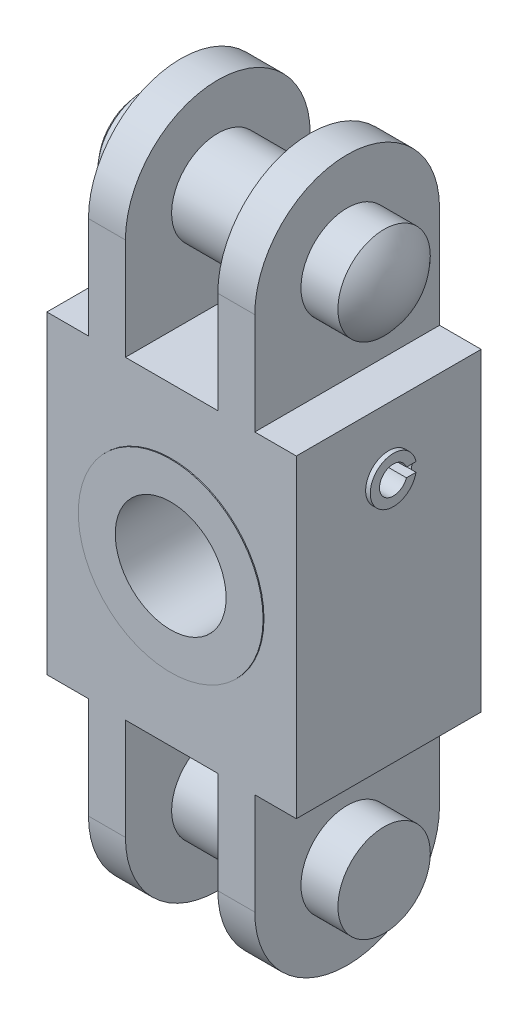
ISO-10303-21;
HEADER;
FILE_DESCRIPTION(('STEP AP214'),'2;1');
FILE_NAME('part.step','',(''),(''),'','','');
FILE_SCHEMA(('AUTOMOTIVE_DESIGN { 1 0 10303 214 1 1 1 1 }'));
ENDSEC;
DATA;
#1=APPLICATION_CONTEXT('core data for automotive mechanical design processes');
#2=APPLICATION_PROTOCOL_DEFINITION('international standard','automotive_design',2000,#1);
#3=PRODUCT_CONTEXT('',#1,'mechanical');
#4=PRODUCT('Part','Part','',(#3));
#5=PRODUCT_RELATED_PRODUCT_CATEGORY('part','',(#4));
#6=PRODUCT_DEFINITION_FORMATION('','',#4);
#7=PRODUCT_DEFINITION_CONTEXT('part definition',#1,'design');
#8=PRODUCT_DEFINITION('design','',#6,#7);
#9=PRODUCT_DEFINITION_SHAPE('','',#8);
#10=(LENGTH_UNIT() NAMED_UNIT(*) SI_UNIT(.MILLI.,.METRE.));
#11=(NAMED_UNIT(*) PLANE_ANGLE_UNIT() SI_UNIT($,.RADIAN.));
#12=(NAMED_UNIT(*) SI_UNIT($,.STERADIAN.) SOLID_ANGLE_UNIT());
#13=UNCERTAINTY_MEASURE_WITH_UNIT(LENGTH_MEASURE(1.E-05),#10,'distance_accuracy_value','');
#14=(GEOMETRIC_REPRESENTATION_CONTEXT(3) GLOBAL_UNCERTAINTY_ASSIGNED_CONTEXT((#13)) GLOBAL_UNIT_ASSIGNED_CONTEXT((#10,
#11,#12)) REPRESENTATION_CONTEXT('',''));
#15=CARTESIAN_POINT('',(0.,0.,0.));
#16=DIRECTION('',(0.,0.,1.));
#17=DIRECTION('',(1.,0.,0.));
#18=AXIS2_PLACEMENT_3D('',#15,#16,#17);
#19=CARTESIAN_POINT('',(-15.,10.,0.));
#20=DIRECTION('',(1.,0.,0.));
#21=DIRECTION('',(0.,0.,-1.));
#22=AXIS2_PLACEMENT_3D('',#19,#20,#21);
#23=CYLINDRICAL_SURFACE('',#22,2.5);
#24=DIRECTION('',(1.,0.,0.));
#25=VECTOR('',#24,1.);
#26=CARTESIAN_POINT('',(-15.,10.5,-2.44948974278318));
#27=LINE('',#26,#25);
#28=CARTESIAN_POINT('',(-13.5,10.5,-2.44948974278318));
#29=VERTEX_POINT('',#28);
#30=CARTESIAN_POINT('',(13.5,10.5,-2.44948974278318));
#31=VERTEX_POINT('',#30);
#32=EDGE_CURVE('E11',#29,#31,#27,.T.);
#33=ORIENTED_EDGE('',*,*,#32,.F.);
#34=CARTESIAN_POINT('',(-13.5,10.,0.));
#35=DIRECTION('',(1.,0.,0.));
#36=DIRECTION('',(0.,0.,-1.));
#37=AXIS2_PLACEMENT_3D('',#34,#35,#36);
#38=CIRCLE('',#37,2.5);
#39=CARTESIAN_POINT('',(-13.5,9.5,-2.44948974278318));
#40=VERTEX_POINT('',#39);
#41=EDGE_CURVE('E253',#40,#29,#38,.T.);
#42=ORIENTED_EDGE('',*,*,#41,.F.);
#43=DIRECTION('',(1.,0.,0.));
#44=VECTOR('',#43,1.);
#45=CARTESIAN_POINT('',(-15.,9.5,-2.44948974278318));
#46=LINE('',#45,#44);
#47=CARTESIAN_POINT('',(13.5,9.5,-2.44948974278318));
#48=VERTEX_POINT('',#47);
#49=EDGE_CURVE('E41',#48,#40,#46,.F.);
#50=ORIENTED_EDGE('',*,*,#49,.F.);
#51=CARTESIAN_POINT('',(13.5,10.,0.));
#52=DIRECTION('',(1.,0.,0.));
#53=DIRECTION('',(0.,0.,-1.));
#54=AXIS2_PLACEMENT_3D('',#51,#52,#53);
#55=CIRCLE('',#54,2.5);
#56=EDGE_CURVE('E223',#48,#31,#55,.T.);
#57=ORIENTED_EDGE('',*,*,#56,.T.);
#58=EDGE_LOOP('',(#33,#42,#50,#57));
#59=FACE_BOUND('',#58,.T.);
#60=ADVANCED_FACE('F33',(#59),#23,.F.);
#61=CARTESIAN_POINT('',(-9.,17.,10.));
#62=DIRECTION('',(0.,0.,1.));
#63=DIRECTION('',(1.,0.,0.));
#64=AXIS2_PLACEMENT_3D('',#61,#62,#63);
#65=PLANE('',#64);
#66=CARTESIAN_POINT('',(0.,0.,10.));
#67=DIRECTION('',(0.,0.,1.));
#68=DIRECTION('',(1.,0.,0.));
#69=AXIS2_PLACEMENT_3D('',#66,#67,#68);
#70=CIRCLE('',#69,10.);
#71=CARTESIAN_POINT('',(10.,0.,10.));
#72=VERTEX_POINT('',#71);
#73=EDGE_CURVE('E333',#72,#72,#70,.T.);
#74=ORIENTED_EDGE('',*,*,#73,.F.);
#75=EDGE_LOOP('',(#74));
#76=FACE_BOUND('',#75,.T.);
#77=DIRECTION('',(0.,1.,0.));
#78=VECTOR('',#77,1.);
#79=CARTESIAN_POINT('',(9.,17.,10.));
#80=LINE('',#79,#78);
#81=CARTESIAN_POINT('',(9.,17.,10.));
#82=VERTEX_POINT('',#81);
#83=CARTESIAN_POINT('',(9.,28.,10.));
#84=VERTEX_POINT('',#83);
#85=EDGE_CURVE('E398',#82,#84,#80,.T.);
#86=ORIENTED_EDGE('',*,*,#85,.T.);
#87=DIRECTION('',(-1.,0.,0.));
#88=VECTOR('',#87,1.);
#89=CARTESIAN_POINT('',(13.5,28.,10.));
#90=LINE('',#89,#88);
#91=CARTESIAN_POINT('',(5.,28.,10.));
#92=VERTEX_POINT('',#91);
#93=EDGE_CURVE('E311',#84,#92,#90,.T.);
#94=ORIENTED_EDGE('',*,*,#93,.T.);
#95=DIRECTION('',(0.,-1.,0.));
#96=VECTOR('',#95,1.);
#97=CARTESIAN_POINT('',(5.,38.,10.));
#98=LINE('',#97,#96);
#99=CARTESIAN_POINT('',(5.,17.,10.));
#100=VERTEX_POINT('',#99);
#101=EDGE_CURVE('E401',#92,#100,#98,.T.);
#102=ORIENTED_EDGE('',*,*,#101,.T.);
#103=DIRECTION('',(-1.,0.,0.));
#104=VECTOR('',#103,1.);
#105=CARTESIAN_POINT('',(-5.,17.,10.));
#106=LINE('',#105,#104);
#107=CARTESIAN_POINT('',(-5.,17.,10.));
#108=VERTEX_POINT('',#107);
#109=EDGE_CURVE('E403',#100,#108,#106,.T.);
#110=ORIENTED_EDGE('',*,*,#109,.T.);
#111=DIRECTION('',(0.,1.,0.));
#112=VECTOR('',#111,1.);
#113=CARTESIAN_POINT('',(-5.,38.,10.));
#114=LINE('',#113,#112);
#115=CARTESIAN_POINT('',(-5.,28.,10.));
#116=VERTEX_POINT('',#115);
#117=EDGE_CURVE('E405',#108,#116,#114,.T.);
#118=ORIENTED_EDGE('',*,*,#117,.T.);
#119=CARTESIAN_POINT('',(-9.,28.,10.));
#120=VERTEX_POINT('',#119);
#121=EDGE_CURVE('E308',#116,#120,#90,.T.);
#122=ORIENTED_EDGE('',*,*,#121,.T.);
#123=DIRECTION('',(0.,-1.,0.));
#124=VECTOR('',#123,1.);
#125=CARTESIAN_POINT('',(-9.,17.,10.));
#126=LINE('',#125,#124);
#127=CARTESIAN_POINT('',(-9.,17.,10.));
#128=VERTEX_POINT('',#127);
#129=EDGE_CURVE('E408',#120,#128,#126,.T.);
#130=ORIENTED_EDGE('',*,*,#129,.T.);
#131=DIRECTION('',(-1.,0.,0.));
#132=VECTOR('',#131,1.);
#133=CARTESIAN_POINT('',(-13.5,17.,10.));
#134=LINE('',#133,#132);
#135=CARTESIAN_POINT('',(-13.5,17.,10.));
#136=VERTEX_POINT('',#135);
#137=EDGE_CURVE('E373',#128,#136,#134,.T.);
#138=ORIENTED_EDGE('',*,*,#137,.T.);
#139=DIRECTION('',(0.,-1.,0.));
#140=VECTOR('',#139,1.);
#141=CARTESIAN_POINT('',(-13.5,-17.,10.));
#142=LINE('',#141,#140);
#143=CARTESIAN_POINT('',(-13.5,-17.,10.));
#144=VERTEX_POINT('',#143);
#145=EDGE_CURVE('E376',#136,#144,#142,.T.);
#146=ORIENTED_EDGE('',*,*,#145,.T.);
#147=DIRECTION('',(1.,0.,0.));
#148=VECTOR('',#147,1.);
#149=CARTESIAN_POINT('',(-13.5,-17.,10.));
#150=LINE('',#149,#148);
#151=CARTESIAN_POINT('',(-9.,-17.,10.));
#152=VERTEX_POINT('',#151);
#153=EDGE_CURVE('E378',#144,#152,#150,.T.);
#154=ORIENTED_EDGE('',*,*,#153,.T.);
#155=DIRECTION('',(0.,-1.,0.));
#156=VECTOR('',#155,1.);
#157=CARTESIAN_POINT('',(-9.,-17.,10.));
#158=LINE('',#157,#156);
#159=CARTESIAN_POINT('',(-9.,-28.,10.));
#160=VERTEX_POINT('',#159);
#161=EDGE_CURVE('E380',#152,#160,#158,.T.);
#162=ORIENTED_EDGE('',*,*,#161,.T.);
#163=DIRECTION('',(-1.,0.,0.));
#164=VECTOR('',#163,1.);
#165=CARTESIAN_POINT('',(13.5,-28.,10.));
#166=LINE('',#165,#164);
#167=CARTESIAN_POINT('',(-5.,-28.,10.));
#168=VERTEX_POINT('',#167);
#169=EDGE_CURVE('E313',#168,#160,#166,.T.);
#170=ORIENTED_EDGE('',*,*,#169,.F.);
#171=DIRECTION('',(0.,1.,0.));
#172=VECTOR('',#171,1.);
#173=CARTESIAN_POINT('',(-5.,-38.,10.));
#174=LINE('',#173,#172);
#175=CARTESIAN_POINT('',(-5.,-17.,10.));
#176=VERTEX_POINT('',#175);
#177=EDGE_CURVE('E383',#168,#176,#174,.T.);
#178=ORIENTED_EDGE('',*,*,#177,.T.);
#179=DIRECTION('',(1.,0.,0.));
#180=VECTOR('',#179,1.);
#181=CARTESIAN_POINT('',(-5.,-17.,10.));
#182=LINE('',#181,#180);
#183=CARTESIAN_POINT('',(5.,-17.,10.));
#184=VERTEX_POINT('',#183);
#185=EDGE_CURVE('E385',#176,#184,#182,.T.);
#186=ORIENTED_EDGE('',*,*,#185,.T.);
#187=DIRECTION('',(0.,-1.,0.));
#188=VECTOR('',#187,1.);
#189=CARTESIAN_POINT('',(5.,-38.,10.));
#190=LINE('',#189,#188);
#191=CARTESIAN_POINT('',(5.,-28.,10.));
#192=VERTEX_POINT('',#191);
#193=EDGE_CURVE('E387',#184,#192,#190,.T.);
#194=ORIENTED_EDGE('',*,*,#193,.T.);
#195=CARTESIAN_POINT('',(9.,-28.,10.));
#196=VERTEX_POINT('',#195);
#197=EDGE_CURVE('E312',#196,#192,#166,.T.);
#198=ORIENTED_EDGE('',*,*,#197,.F.);
#199=DIRECTION('',(0.,1.,0.));
#200=VECTOR('',#199,1.);
#201=CARTESIAN_POINT('',(9.,-17.,10.));
#202=LINE('',#201,#200);
#203=CARTESIAN_POINT('',(9.,-17.,10.));
#204=VERTEX_POINT('',#203);
#205=EDGE_CURVE('E390',#196,#204,#202,.T.);
#206=ORIENTED_EDGE('',*,*,#205,.T.);
#207=DIRECTION('',(1.,0.,0.));
#208=VECTOR('',#207,1.);
#209=CARTESIAN_POINT('',(13.5,-17.,10.));
#210=LINE('',#209,#208);
#211=CARTESIAN_POINT('',(13.5,-17.,10.));
#212=VERTEX_POINT('',#211);
#213=EDGE_CURVE('E392',#204,#212,#210,.T.);
#214=ORIENTED_EDGE('',*,*,#213,.T.);
#215=DIRECTION('',(0.,1.,0.));
#216=VECTOR('',#215,1.);
#217=CARTESIAN_POINT('',(13.5,-17.,10.));
#218=LINE('',#217,#216);
#219=CARTESIAN_POINT('',(13.5,17.,10.));
#220=VERTEX_POINT('',#219);
#221=EDGE_CURVE('E394',#212,#220,#218,.T.);
#222=ORIENTED_EDGE('',*,*,#221,.T.);
#223=DIRECTION('',(-1.,0.,0.));
#224=VECTOR('',#223,1.);
#225=CARTESIAN_POINT('',(13.5,17.,10.));
#226=LINE('',#225,#224);
#227=EDGE_CURVE('E396',#220,#82,#226,.T.);
#228=ORIENTED_EDGE('',*,*,#227,.T.);
#229=EDGE_LOOP('',(#86,#94,#102,#110,#118,#122,#130,#138,#146,#154,#162,#170,#178,#186,#194,
#198,#206,#214,#222,#228));
#230=FACE_BOUND('',#229,.T.);
#231=ADVANCED_FACE('F468',(#76,#230),#65,.T.);
#232=CARTESIAN_POINT('',(-9.,17.,-10.));
#233=DIRECTION('',(0.,0.,1.));
#234=DIRECTION('',(1.,0.,0.));
#235=AXIS2_PLACEMENT_3D('',#232,#233,#234);
#236=PLANE('',#235);
#237=CARTESIAN_POINT('',(0.,0.,-10.));
#238=DIRECTION('',(0.,0.,1.));
#239=DIRECTION('',(1.,0.,0.));
#240=AXIS2_PLACEMENT_3D('',#237,#238,#239);
#241=CIRCLE('',#240,10.);
#242=CARTESIAN_POINT('',(10.,0.,-10.));
#243=VERTEX_POINT('',#242);
#244=EDGE_CURVE('E268',#243,#243,#241,.F.);
#245=ORIENTED_EDGE('',*,*,#244,.F.);
#246=EDGE_LOOP('',(#245));
#247=FACE_BOUND('',#246,.T.);
#248=DIRECTION('',(-1.,0.,0.));
#249=VECTOR('',#248,1.);
#250=CARTESIAN_POINT('',(13.5,28.,-10.));
#251=LINE('',#250,#249);
#252=CARTESIAN_POINT('',(9.,28.,-10.));
#253=VERTEX_POINT('',#252);
#254=CARTESIAN_POINT('',(5.,28.,-10.));
#255=VERTEX_POINT('',#254);
#256=EDGE_CURVE('E319',#253,#255,#251,.T.);
#257=ORIENTED_EDGE('',*,*,#256,.F.);
#258=DIRECTION('',(0.,1.,0.));
#259=VECTOR('',#258,1.);
#260=CARTESIAN_POINT('',(9.,17.,-10.));
#261=LINE('',#260,#259);
#262=CARTESIAN_POINT('',(9.,17.,-10.));
#263=VERTEX_POINT('',#262);
#264=EDGE_CURVE('E361',#263,#253,#261,.T.);
#265=ORIENTED_EDGE('',*,*,#264,.F.);
#266=DIRECTION('',(-1.,0.,0.));
#267=VECTOR('',#266,1.);
#268=CARTESIAN_POINT('',(13.5,17.,-10.));
#269=LINE('',#268,#267);
#270=CARTESIAN_POINT('',(13.5,17.,-10.));
#271=VERTEX_POINT('',#270);
#272=EDGE_CURVE('E359',#271,#263,#269,.T.);
#273=ORIENTED_EDGE('',*,*,#272,.F.);
#274=DIRECTION('',(0.,1.,0.));
#275=VECTOR('',#274,1.);
#276=CARTESIAN_POINT('',(13.5,-17.,-10.));
#277=LINE('',#276,#275);
#278=CARTESIAN_POINT('',(13.5,-17.,-10.));
#279=VERTEX_POINT('',#278);
#280=EDGE_CURVE('E357',#279,#271,#277,.T.);
#281=ORIENTED_EDGE('',*,*,#280,.F.);
#282=DIRECTION('',(1.,0.,0.));
#283=VECTOR('',#282,1.);
#284=CARTESIAN_POINT('',(13.5,-17.,-10.));
#285=LINE('',#284,#283);
#286=CARTESIAN_POINT('',(9.,-17.,-10.));
#287=VERTEX_POINT('',#286);
#288=EDGE_CURVE('E355',#287,#279,#285,.T.);
#289=ORIENTED_EDGE('',*,*,#288,.F.);
#290=DIRECTION('',(0.,1.,0.));
#291=VECTOR('',#290,1.);
#292=CARTESIAN_POINT('',(9.,-17.,-10.));
#293=LINE('',#292,#291);
#294=CARTESIAN_POINT('',(9.,-28.,-10.));
#295=VERTEX_POINT('',#294);
#296=EDGE_CURVE('E353',#295,#287,#293,.T.);
#297=ORIENTED_EDGE('',*,*,#296,.F.);
#298=DIRECTION('',(-1.,0.,0.));
#299=VECTOR('',#298,1.);
#300=CARTESIAN_POINT('',(13.5,-28.,-10.));
#301=LINE('',#300,#299);
#302=CARTESIAN_POINT('',(5.,-28.,-10.));
#303=VERTEX_POINT('',#302);
#304=EDGE_CURVE('E315',#295,#303,#301,.T.);
#305=ORIENTED_EDGE('',*,*,#304,.T.);
#306=DIRECTION('',(0.,-1.,0.));
#307=VECTOR('',#306,1.);
#308=CARTESIAN_POINT('',(5.,-38.,-10.));
#309=LINE('',#308,#307);
#310=CARTESIAN_POINT('',(5.,-17.,-10.));
#311=VERTEX_POINT('',#310);
#312=EDGE_CURVE('E350',#311,#303,#309,.T.);
#313=ORIENTED_EDGE('',*,*,#312,.F.);
#314=DIRECTION('',(1.,0.,0.));
#315=VECTOR('',#314,1.);
#316=CARTESIAN_POINT('',(-5.,-17.,-10.));
#317=LINE('',#316,#315);
#318=CARTESIAN_POINT('',(-5.,-17.,-10.));
#319=VERTEX_POINT('',#318);
#320=EDGE_CURVE('E348',#319,#311,#317,.T.);
#321=ORIENTED_EDGE('',*,*,#320,.F.);
#322=DIRECTION('',(0.,1.,0.));
#323=VECTOR('',#322,1.);
#324=CARTESIAN_POINT('',(-5.,-38.,-10.));
#325=LINE('',#324,#323);
#326=CARTESIAN_POINT('',(-5.,-28.,-10.));
#327=VERTEX_POINT('',#326);
#328=EDGE_CURVE('E346',#327,#319,#325,.T.);
#329=ORIENTED_EDGE('',*,*,#328,.F.);
#330=CARTESIAN_POINT('',(-9.,-28.,-10.));
#331=VERTEX_POINT('',#330);
#332=EDGE_CURVE('E316',#327,#331,#301,.T.);
#333=ORIENTED_EDGE('',*,*,#332,.T.);
#334=DIRECTION('',(0.,-1.,0.));
#335=VECTOR('',#334,1.);
#336=CARTESIAN_POINT('',(-9.,-17.,-10.));
#337=LINE('',#336,#335);
#338=CARTESIAN_POINT('',(-9.,-17.,-10.));
#339=VERTEX_POINT('',#338);
#340=EDGE_CURVE('E343',#339,#331,#337,.T.);
#341=ORIENTED_EDGE('',*,*,#340,.F.);
#342=DIRECTION('',(1.,0.,0.));
#343=VECTOR('',#342,1.);
#344=CARTESIAN_POINT('',(-13.5,-17.,-10.));
#345=LINE('',#344,#343);
#346=CARTESIAN_POINT('',(-13.5,-17.,-10.));
#347=VERTEX_POINT('',#346);
#348=EDGE_CURVE('E341',#347,#339,#345,.T.);
#349=ORIENTED_EDGE('',*,*,#348,.F.);
#350=DIRECTION('',(0.,-1.,0.));
#351=VECTOR('',#350,1.);
#352=CARTESIAN_POINT('',(-13.5,-17.,-10.));
#353=LINE('',#352,#351);
#354=CARTESIAN_POINT('',(-13.5,17.,-10.));
#355=VERTEX_POINT('',#354);
#356=EDGE_CURVE('E339',#355,#347,#353,.T.);
#357=ORIENTED_EDGE('',*,*,#356,.F.);
#358=DIRECTION('',(-1.,0.,0.));
#359=VECTOR('',#358,1.);
#360=CARTESIAN_POINT('',(-13.5,17.,-10.));
#361=LINE('',#360,#359);
#362=CARTESIAN_POINT('',(-9.,17.,-10.));
#363=VERTEX_POINT('',#362);
#364=EDGE_CURVE('E336',#363,#355,#361,.T.);
#365=ORIENTED_EDGE('',*,*,#364,.F.);
#366=DIRECTION('',(0.,-1.,0.));
#367=VECTOR('',#366,1.);
#368=CARTESIAN_POINT('',(-9.,17.,-10.));
#369=LINE('',#368,#367);
#370=CARTESIAN_POINT('',(-9.,28.,-10.));
#371=VERTEX_POINT('',#370);
#372=EDGE_CURVE('E371',#371,#363,#369,.T.);
#373=ORIENTED_EDGE('',*,*,#372,.F.);
#374=CARTESIAN_POINT('',(-5.,28.,-10.));
#375=VERTEX_POINT('',#374);
#376=EDGE_CURVE('E307',#375,#371,#251,.T.);
#377=ORIENTED_EDGE('',*,*,#376,.F.);
#378=DIRECTION('',(0.,1.,0.));
#379=VECTOR('',#378,1.);
#380=CARTESIAN_POINT('',(-5.,38.,-10.));
#381=LINE('',#380,#379);
#382=CARTESIAN_POINT('',(-5.,17.,-10.));
#383=VERTEX_POINT('',#382);
#384=EDGE_CURVE('E368',#383,#375,#381,.T.);
#385=ORIENTED_EDGE('',*,*,#384,.F.);
#386=DIRECTION('',(-1.,0.,0.));
#387=VECTOR('',#386,1.);
#388=CARTESIAN_POINT('',(-5.,17.,-10.));
#389=LINE('',#388,#387);
#390=CARTESIAN_POINT('',(5.,17.,-10.));
#391=VERTEX_POINT('',#390);
#392=EDGE_CURVE('E366',#391,#383,#389,.T.);
#393=ORIENTED_EDGE('',*,*,#392,.F.);
#394=DIRECTION('',(0.,-1.,0.));
#395=VECTOR('',#394,1.);
#396=CARTESIAN_POINT('',(5.,38.,-10.));
#397=LINE('',#396,#395);
#398=EDGE_CURVE('E364',#255,#391,#397,.T.);
#399=ORIENTED_EDGE('',*,*,#398,.F.);
#400=EDGE_LOOP('',(#257,#265,#273,#281,#289,#297,#305,#313,#321,#329,#333,#341,#349,#357,#365,
#373,#377,#385,#393,#399));
#401=FACE_BOUND('',#400,.T.);
#402=ADVANCED_FACE('F473',(#247,#401),#236,.F.);
#403=CARTESIAN_POINT('',(-9.,-17.,10.));
#404=DIRECTION('',(1.,0.,0.));
#405=DIRECTION('',(0.,1.,0.));
#406=AXIS2_PLACEMENT_3D('',#403,#404,#405);
#407=PLANE('',#406);
#408=CARTESIAN_POINT('',(-9.,-28.,0.));
#409=DIRECTION('',(-1.,0.,0.));
#410=DIRECTION('',(0.,-1.,0.));
#411=AXIS2_PLACEMENT_3D('',#408,#409,#410);
#412=CIRCLE('',#411,5.);
#413=CARTESIAN_POINT('',(-9.,-33.,0.));
#414=VERTEX_POINT('',#413);
#415=EDGE_CURVE('E301',#414,#414,#412,.T.);
#416=ORIENTED_EDGE('',*,*,#415,.F.);
#417=EDGE_LOOP('',(#416));
#418=FACE_BOUND('',#417,.T.);
#419=CARTESIAN_POINT('',(-9.,-28.,0.));
#420=DIRECTION('',(1.,0.,0.));
#421=DIRECTION('',(0.,1.,0.));
#422=AXIS2_PLACEMENT_3D('',#419,#420,#421);
#423=CIRCLE('',#422,10.);
#424=EDGE_CURVE('E331',#160,#331,#423,.T.);
#425=ORIENTED_EDGE('',*,*,#424,.F.);
#426=ORIENTED_EDGE('',*,*,#161,.F.);
#427=DIRECTION('',(0.,0.,-1.));
#428=VECTOR('',#427,1.);
#429=CARTESIAN_POINT('',(-9.,-17.,10.));
#430=LINE('',#429,#428);
#431=EDGE_CURVE('E437',#152,#339,#430,.T.);
#432=ORIENTED_EDGE('',*,*,#431,.T.);
#433=ORIENTED_EDGE('',*,*,#340,.T.);
#434=EDGE_LOOP('',(#425,#426,#432,#433));
#435=FACE_BOUND('',#434,.T.);
#436=ADVANCED_FACE('F528',(#418,#435),#407,.F.);
#437=CARTESIAN_POINT('',(-5.,-38.,10.));
#438=DIRECTION('',(-1.,0.,0.));
#439=DIRECTION('',(0.,-1.,0.));
#440=AXIS2_PLACEMENT_3D('',#437,#438,#439);
#441=PLANE('',#440);
#442=CARTESIAN_POINT('',(-5.,-28.,0.));
#443=DIRECTION('',(-1.,0.,0.));
#444=DIRECTION('',(0.,-1.,0.));
#445=AXIS2_PLACEMENT_3D('',#442,#443,#444);
#446=CIRCLE('',#445,5.);
#447=CARTESIAN_POINT('',(-5.,-33.,0.));
#448=VERTEX_POINT('',#447);
#449=EDGE_CURVE('E298',#448,#448,#446,.F.);
#450=ORIENTED_EDGE('',*,*,#449,.F.);
#451=EDGE_LOOP('',(#450));
#452=FACE_BOUND('',#451,.T.);
#453=ORIENTED_EDGE('',*,*,#177,.F.);
#454=CARTESIAN_POINT('',(-5.,-28.,0.));
#455=DIRECTION('',(-1.,0.,0.));
#456=DIRECTION('',(0.,-1.,0.));
#457=AXIS2_PLACEMENT_3D('',#454,#455,#456);
#458=CIRCLE('',#457,10.);
#459=EDGE_CURVE('E329',#327,#168,#458,.T.);
#460=ORIENTED_EDGE('',*,*,#459,.F.);
#461=ORIENTED_EDGE('',*,*,#328,.T.);
#462=DIRECTION('',(0.,0.,-1.));
#463=VECTOR('',#462,1.);
#464=CARTESIAN_POINT('',(-5.,-17.,10.));
#465=LINE('',#464,#463);
#466=EDGE_CURVE('E434',#176,#319,#465,.T.);
#467=ORIENTED_EDGE('',*,*,#466,.F.);
#468=EDGE_LOOP('',(#453,#460,#461,#467));
#469=FACE_BOUND('',#468,.T.);
#470=ADVANCED_FACE('F570',(#452,#469),#441,.F.);
#471=CARTESIAN_POINT('',(5.,-38.,10.));
#472=DIRECTION('',(1.,0.,0.));
#473=DIRECTION('',(0.,1.,0.));
#474=AXIS2_PLACEMENT_3D('',#471,#472,#473);
#475=PLANE('',#474);
#476=CARTESIAN_POINT('',(5.,-28.,0.));
#477=DIRECTION('',(1.,0.,0.));
#478=DIRECTION('',(0.,1.,0.));
#479=AXIS2_PLACEMENT_3D('',#476,#477,#478);
#480=CIRCLE('',#479,5.);
#481=CARTESIAN_POINT('',(5.,-23.,0.));
#482=VERTEX_POINT('',#481);
#483=EDGE_CURVE('E295',#482,#482,#480,.F.);
#484=ORIENTED_EDGE('',*,*,#483,.F.);
#485=EDGE_LOOP('',(#484));
#486=FACE_BOUND('',#485,.T.);
#487=CARTESIAN_POINT('',(5.,-28.,0.));
#488=DIRECTION('',(1.,0.,0.));
#489=DIRECTION('',(0.,1.,0.));
#490=AXIS2_PLACEMENT_3D('',#487,#488,#489);
#491=CIRCLE('',#490,10.);
#492=EDGE_CURVE('E327',#192,#303,#491,.T.);
#493=ORIENTED_EDGE('',*,*,#492,.F.);
#494=ORIENTED_EDGE('',*,*,#193,.F.);
#495=DIRECTION('',(0.,0.,-1.));
#496=VECTOR('',#495,1.);
#497=CARTESIAN_POINT('',(5.,-17.,10.));
#498=LINE('',#497,#496);
#499=EDGE_CURVE('E431',#184,#311,#498,.T.);
#500=ORIENTED_EDGE('',*,*,#499,.T.);
#501=ORIENTED_EDGE('',*,*,#312,.T.);
#502=EDGE_LOOP('',(#493,#494,#500,#501));
#503=FACE_BOUND('',#502,.T.);
#504=ADVANCED_FACE('F566',(#486,#503),#475,.F.);
#505=CARTESIAN_POINT('',(9.,-17.,10.));
#506=DIRECTION('',(-1.,0.,0.));
#507=DIRECTION('',(0.,-1.,0.));
#508=AXIS2_PLACEMENT_3D('',#505,#506,#507);
#509=PLANE('',#508);
#510=CARTESIAN_POINT('',(9.,-28.,0.));
#511=DIRECTION('',(-1.,0.,0.));
#512=DIRECTION('',(0.,-1.,0.));
#513=AXIS2_PLACEMENT_3D('',#510,#511,#512);
#514=CIRCLE('',#513,5.);
#515=CARTESIAN_POINT('',(9.,-33.,0.));
#516=VERTEX_POINT('',#515);
#517=EDGE_CURVE('E292',#516,#516,#514,.F.);
#518=ORIENTED_EDGE('',*,*,#517,.F.);
#519=EDGE_LOOP('',(#518));
#520=FACE_BOUND('',#519,.T.);
#521=ORIENTED_EDGE('',*,*,#205,.F.);
#522=CARTESIAN_POINT('',(9.,-28.,0.));
#523=DIRECTION('',(-1.,0.,0.));
#524=DIRECTION('',(0.,-1.,0.));
#525=AXIS2_PLACEMENT_3D('',#522,#523,#524);
#526=CIRCLE('',#525,10.);
#527=EDGE_CURVE('E448',#295,#196,#526,.T.);
#528=ORIENTED_EDGE('',*,*,#527,.F.);
#529=ORIENTED_EDGE('',*,*,#296,.T.);
#530=DIRECTION('',(0.,0.,-1.));
#531=VECTOR('',#530,1.);
#532=CARTESIAN_POINT('',(9.,-17.,10.));
#533=LINE('',#532,#531);
#534=EDGE_CURVE('E428',#204,#287,#533,.T.);
#535=ORIENTED_EDGE('',*,*,#534,.F.);
#536=EDGE_LOOP('',(#521,#528,#529,#535));
#537=FACE_BOUND('',#536,.T.);
#538=ADVANCED_FACE('F552',(#520,#537),#509,.F.);
#539=CARTESIAN_POINT('',(9.,17.,10.));
#540=DIRECTION('',(-1.,0.,0.));
#541=DIRECTION('',(0.,-1.,0.));
#542=AXIS2_PLACEMENT_3D('',#539,#540,#541);
#543=PLANE('',#542);
#544=CARTESIAN_POINT('',(9.,28.,0.));
#545=DIRECTION('',(-1.,0.,0.));
#546=DIRECTION('',(0.,-1.,0.));
#547=AXIS2_PLACEMENT_3D('',#544,#545,#546);
#548=CIRCLE('',#547,5.);
#549=CARTESIAN_POINT('',(9.,23.,0.));
#550=VERTEX_POINT('',#549);
#551=EDGE_CURVE('E283',#550,#550,#548,.F.);
#552=ORIENTED_EDGE('',*,*,#551,.F.);
#553=EDGE_LOOP('',(#552));
#554=FACE_BOUND('',#553,.T.);
#555=CARTESIAN_POINT('',(9.,28.,0.));
#556=DIRECTION('',(-1.,0.,0.));
#557=DIRECTION('',(0.,-1.,0.));
#558=AXIS2_PLACEMENT_3D('',#555,#556,#557);
#559=CIRCLE('',#558,10.);
#560=EDGE_CURVE('E325',#84,#253,#559,.T.);
#561=ORIENTED_EDGE('',*,*,#560,.F.);
#562=ORIENTED_EDGE('',*,*,#85,.F.);
#563=DIRECTION('',(0.,0.,-1.));
#564=VECTOR('',#563,1.);
#565=CARTESIAN_POINT('',(9.,17.,10.));
#566=LINE('',#565,#564);
#567=EDGE_CURVE('E419',#82,#263,#566,.T.);
#568=ORIENTED_EDGE('',*,*,#567,.T.);
#569=ORIENTED_EDGE('',*,*,#264,.T.);
#570=EDGE_LOOP('',(#561,#562,#568,#569));
#571=FACE_BOUND('',#570,.T.);
#572=ADVANCED_FACE('F548',(#554,#571),#543,.F.);
#573=CARTESIAN_POINT('',(5.,38.,10.));
#574=DIRECTION('',(1.,0.,0.));
#575=DIRECTION('',(0.,1.,0.));
#576=AXIS2_PLACEMENT_3D('',#573,#574,#575);
#577=PLANE('',#576);
#578=CARTESIAN_POINT('',(5.,28.,0.));
#579=DIRECTION('',(1.,0.,0.));
#580=DIRECTION('',(0.,1.,0.));
#581=AXIS2_PLACEMENT_3D('',#578,#579,#580);
#582=CIRCLE('',#581,5.);
#583=CARTESIAN_POINT('',(5.,33.,0.));
#584=VERTEX_POINT('',#583);
#585=EDGE_CURVE('E280',#584,#584,#582,.F.);
#586=ORIENTED_EDGE('',*,*,#585,.F.);
#587=EDGE_LOOP('',(#586));
#588=FACE_BOUND('',#587,.T.);
#589=ORIENTED_EDGE('',*,*,#101,.F.);
#590=CARTESIAN_POINT('',(5.,28.,0.));
#591=DIRECTION('',(1.,0.,0.));
#592=DIRECTION('',(0.,1.,0.));
#593=AXIS2_PLACEMENT_3D('',#590,#591,#592);
#594=CIRCLE('',#593,10.);
#595=EDGE_CURVE('E323',#255,#92,#594,.T.);
#596=ORIENTED_EDGE('',*,*,#595,.F.);
#597=ORIENTED_EDGE('',*,*,#398,.T.);
#598=DIRECTION('',(0.,0.,-1.));
#599=VECTOR('',#598,1.);
#600=CARTESIAN_POINT('',(5.,17.,10.));
#601=LINE('',#600,#599);
#602=EDGE_CURVE('E416',#100,#391,#601,.T.);
#603=ORIENTED_EDGE('',*,*,#602,.F.);
#604=EDGE_LOOP('',(#589,#596,#597,#603));
#605=FACE_BOUND('',#604,.T.);
#606=ADVANCED_FACE('F539',(#588,#605),#577,.F.);
#607=CARTESIAN_POINT('',(-5.,38.,10.));
#608=DIRECTION('',(-1.,0.,0.));
#609=DIRECTION('',(0.,-1.,0.));
#610=AXIS2_PLACEMENT_3D('',#607,#608,#609);
#611=PLANE('',#610);
#612=CARTESIAN_POINT('',(-5.,28.,0.));
#613=DIRECTION('',(-1.,0.,0.));
#614=DIRECTION('',(0.,-1.,0.));
#615=AXIS2_PLACEMENT_3D('',#612,#613,#614);
#616=CIRCLE('',#615,5.);
#617=CARTESIAN_POINT('',(-5.,23.,0.));
#618=VERTEX_POINT('',#617);
#619=EDGE_CURVE('E277',#618,#618,#616,.F.);
#620=ORIENTED_EDGE('',*,*,#619,.F.);
#621=EDGE_LOOP('',(#620));
#622=FACE_BOUND('',#621,.T.);
#623=CARTESIAN_POINT('',(-5.,28.,0.));
#624=DIRECTION('',(-1.,0.,0.));
#625=DIRECTION('',(0.,-1.,0.));
#626=AXIS2_PLACEMENT_3D('',#623,#624,#625);
#627=CIRCLE('',#626,10.);
#628=EDGE_CURVE('E321',#116,#375,#627,.T.);
#629=ORIENTED_EDGE('',*,*,#628,.F.);
#630=ORIENTED_EDGE('',*,*,#117,.F.);
#631=DIRECTION('',(0.,0.,-1.));
#632=VECTOR('',#631,1.);
#633=CARTESIAN_POINT('',(-5.,17.,10.));
#634=LINE('',#633,#632);
#635=EDGE_CURVE('E413',#108,#383,#634,.T.);
#636=ORIENTED_EDGE('',*,*,#635,.T.);
#637=ORIENTED_EDGE('',*,*,#384,.T.);
#638=EDGE_LOOP('',(#629,#630,#636,#637));
#639=FACE_BOUND('',#638,.T.);
#640=ADVANCED_FACE('F535',(#622,#639),#611,.F.);
#641=CARTESIAN_POINT('',(-9.,17.,10.));
#642=DIRECTION('',(1.,0.,0.));
#643=DIRECTION('',(0.,1.,0.));
#644=AXIS2_PLACEMENT_3D('',#641,#642,#643);
#645=PLANE('',#644);
#646=CARTESIAN_POINT('',(-9.,28.,0.));
#647=DIRECTION('',(-1.,0.,0.));
#648=DIRECTION('',(0.,-1.,0.));
#649=AXIS2_PLACEMENT_3D('',#646,#647,#648);
#650=CIRCLE('',#649,5.);
#651=CARTESIAN_POINT('',(-9.,23.,0.));
#652=VERTEX_POINT('',#651);
#653=EDGE_CURVE('E304',#652,#652,#650,.T.);
#654=ORIENTED_EDGE('',*,*,#653,.F.);
#655=EDGE_LOOP('',(#654));
#656=FACE_BOUND('',#655,.T.);
#657=ORIENTED_EDGE('',*,*,#129,.F.);
#658=CARTESIAN_POINT('',(-9.,28.,0.));
#659=DIRECTION('',(1.,0.,0.));
#660=DIRECTION('',(0.,1.,0.));
#661=AXIS2_PLACEMENT_3D('',#658,#659,#660);
#662=CIRCLE('',#661,10.);
#663=EDGE_CURVE('E446',#371,#120,#662,.T.);
#664=ORIENTED_EDGE('',*,*,#663,.F.);
#665=ORIENTED_EDGE('',*,*,#372,.T.);
#666=DIRECTION('',(0.,0.,-1.));
#667=VECTOR('',#666,1.);
#668=CARTESIAN_POINT('',(-9.,17.,10.));
#669=LINE('',#668,#667);
#670=EDGE_CURVE('E410',#128,#363,#669,.T.);
#671=ORIENTED_EDGE('',*,*,#670,.F.);
#672=EDGE_LOOP('',(#657,#664,#665,#671));
#673=FACE_BOUND('',#672,.T.);
#674=ADVANCED_FACE('F531',(#656,#673),#645,.F.);
#675=CARTESIAN_POINT('',(-13.5,17.,10.));
#676=DIRECTION('',(0.,-1.,0.));
#677=DIRECTION('',(1.,0.,0.));
#678=AXIS2_PLACEMENT_3D('',#675,#676,#677);
#679=PLANE('',#678);
#680=ORIENTED_EDGE('',*,*,#364,.T.);
#681=DIRECTION('',(0.,0.,-1.));
#682=VECTOR('',#681,1.);
#683=CARTESIAN_POINT('',(-13.5,17.,10.));
#684=LINE('',#683,#682);
#685=EDGE_CURVE('E443',#136,#355,#684,.T.);
#686=ORIENTED_EDGE('',*,*,#685,.F.);
#687=ORIENTED_EDGE('',*,*,#137,.F.);
#688=ORIENTED_EDGE('',*,*,#670,.T.);
#689=EDGE_LOOP('',(#680,#686,#687,#688));
#690=FACE_BOUND('',#689,.T.);
#691=ADVANCED_FACE('F534',(#690),#679,.F.);
#692=CARTESIAN_POINT('',(-13.5,-17.,10.));
#693=DIRECTION('',(1.,0.,0.));
#694=DIRECTION('',(0.,0.,-1.));
#695=AXIS2_PLACEMENT_3D('',#692,#693,#694);
#696=PLANE('',#695);
#697=EDGE_CURVE('E254',#29,#40,#38,.T.);
#698=ORIENTED_EDGE('',*,*,#697,.T.);
#699=ORIENTED_EDGE('',*,*,#41,.T.);
#700=EDGE_LOOP('',(#698,#699));
#701=FACE_BOUND('',#700,.T.);
#702=ORIENTED_EDGE('',*,*,#356,.T.);
#703=DIRECTION('',(0.,0.,-1.));
#704=VECTOR('',#703,1.);
#705=CARTESIAN_POINT('',(-13.5,-17.,10.));
#706=LINE('',#705,#704);
#707=EDGE_CURVE('E440',#144,#347,#706,.T.);
#708=ORIENTED_EDGE('',*,*,#707,.F.);
#709=ORIENTED_EDGE('',*,*,#145,.F.);
#710=ORIENTED_EDGE('',*,*,#685,.T.);
#711=EDGE_LOOP('',(#702,#708,#709,#710));
#712=FACE_BOUND('',#711,.T.);
#713=ADVANCED_FACE('F465',(#701,#712),#696,.F.);
#714=CARTESIAN_POINT('',(-13.5,-17.,10.));
#715=DIRECTION('',(0.,1.,0.));
#716=DIRECTION('',(-1.,0.,0.));
#717=AXIS2_PLACEMENT_3D('',#714,#715,#716);
#718=PLANE('',#717);
#719=ORIENTED_EDGE('',*,*,#348,.T.);
#720=ORIENTED_EDGE('',*,*,#431,.F.);
#721=ORIENTED_EDGE('',*,*,#153,.F.);
#722=ORIENTED_EDGE('',*,*,#707,.T.);
#723=EDGE_LOOP('',(#719,#720,#721,#722));
#724=FACE_BOUND('',#723,.T.);
#725=ADVANCED_FACE('F574',(#724),#718,.F.);
#726=CARTESIAN_POINT('',(-5.,-17.,10.));
#727=DIRECTION('',(0.,1.,0.));
#728=DIRECTION('',(0.,0.,1.));
#729=AXIS2_PLACEMENT_3D('',#726,#727,#728);
#730=PLANE('',#729);
#731=ORIENTED_EDGE('',*,*,#320,.T.);
#732=ORIENTED_EDGE('',*,*,#499,.F.);
#733=ORIENTED_EDGE('',*,*,#185,.F.);
#734=ORIENTED_EDGE('',*,*,#466,.T.);
#735=EDGE_LOOP('',(#731,#732,#733,#734));
#736=FACE_BOUND('',#735,.T.);
#737=ADVANCED_FACE('F562',(#736),#730,.F.);
#738=CARTESIAN_POINT('',(13.5,-17.,10.));
#739=DIRECTION('',(0.,1.,0.));
#740=DIRECTION('',(-1.,0.,0.));
#741=AXIS2_PLACEMENT_3D('',#738,#739,#740);
#742=PLANE('',#741);
#743=ORIENTED_EDGE('',*,*,#288,.T.);
#744=DIRECTION('',(0.,0.,-1.));
#745=VECTOR('',#744,1.);
#746=CARTESIAN_POINT('',(13.5,-17.,10.));
#747=LINE('',#746,#745);
#748=EDGE_CURVE('E425',#212,#279,#747,.T.);
#749=ORIENTED_EDGE('',*,*,#748,.F.);
#750=ORIENTED_EDGE('',*,*,#213,.F.);
#751=ORIENTED_EDGE('',*,*,#534,.T.);
#752=EDGE_LOOP('',(#743,#749,#750,#751));
#753=FACE_BOUND('',#752,.T.);
#754=ADVANCED_FACE('F559',(#753),#742,.F.);
#755=CARTESIAN_POINT('',(13.5,-17.,10.));
#756=DIRECTION('',(-1.,0.,0.));
#757=DIRECTION('',(0.,0.,1.));
#758=AXIS2_PLACEMENT_3D('',#755,#756,#757);
#759=PLANE('',#758);
#760=EDGE_CURVE('E250',#31,#48,#55,.T.);
#761=ORIENTED_EDGE('',*,*,#760,.F.);
#762=ORIENTED_EDGE('',*,*,#56,.F.);
#763=EDGE_LOOP('',(#761,#762));
#764=FACE_BOUND('',#763,.T.);
#765=ORIENTED_EDGE('',*,*,#280,.T.);
#766=DIRECTION('',(0.,0.,-1.));
#767=VECTOR('',#766,1.);
#768=CARTESIAN_POINT('',(13.5,17.,10.));
#769=LINE('',#768,#767);
#770=EDGE_CURVE('E422',#220,#271,#769,.T.);
#771=ORIENTED_EDGE('',*,*,#770,.F.);
#772=ORIENTED_EDGE('',*,*,#221,.F.);
#773=ORIENTED_EDGE('',*,*,#748,.T.);
#774=EDGE_LOOP('',(#765,#771,#772,#773));
#775=FACE_BOUND('',#774,.T.);
#776=ADVANCED_FACE('F459',(#764,#775),#759,.F.);
#777=CARTESIAN_POINT('',(13.5,17.,10.));
#778=DIRECTION('',(0.,-1.,0.));
#779=DIRECTION('',(1.,0.,0.));
#780=AXIS2_PLACEMENT_3D('',#777,#778,#779);
#781=PLANE('',#780);
#782=ORIENTED_EDGE('',*,*,#272,.T.);
#783=ORIENTED_EDGE('',*,*,#567,.F.);
#784=ORIENTED_EDGE('',*,*,#227,.F.);
#785=ORIENTED_EDGE('',*,*,#770,.T.);
#786=EDGE_LOOP('',(#782,#783,#784,#785));
#787=FACE_BOUND('',#786,.T.);
#788=ADVANCED_FACE('F544',(#787),#781,.F.);
#789=CARTESIAN_POINT('',(-5.,17.,10.));
#790=DIRECTION('',(0.,-1.,0.));
#791=DIRECTION('',(0.,0.,-1.));
#792=AXIS2_PLACEMENT_3D('',#789,#790,#791);
#793=PLANE('',#792);
#794=ORIENTED_EDGE('',*,*,#392,.T.);
#795=ORIENTED_EDGE('',*,*,#635,.F.);
#796=ORIENTED_EDGE('',*,*,#109,.F.);
#797=ORIENTED_EDGE('',*,*,#602,.T.);
#798=EDGE_LOOP('',(#794,#795,#796,#797));
#799=FACE_BOUND('',#798,.T.);
#800=ADVANCED_FACE('F541',(#799),#793,.F.);
#801=CARTESIAN_POINT('',(13.5,28.,0.));
#802=DIRECTION('',(-1.,0.,0.));
#803=DIRECTION('',(0.,0.,1.));
#804=AXIS2_PLACEMENT_3D('',#801,#802,#803);
#805=CYLINDRICAL_SURFACE('',#804,10.);
#806=ORIENTED_EDGE('',*,*,#628,.T.);
#807=ORIENTED_EDGE('',*,*,#376,.T.);
#808=ORIENTED_EDGE('',*,*,#663,.T.);
#809=ORIENTED_EDGE('',*,*,#121,.F.);
#810=EDGE_LOOP('',(#806,#807,#808,#809));
#811=FACE_BOUND('',#810,.T.);
#812=ADVANCED_FACE('F525',(#811),#805,.T.);
#813=ORIENTED_EDGE('',*,*,#560,.T.);
#814=ORIENTED_EDGE('',*,*,#256,.T.);
#815=ORIENTED_EDGE('',*,*,#595,.T.);
#816=ORIENTED_EDGE('',*,*,#93,.F.);
#817=EDGE_LOOP('',(#813,#814,#815,#816));
#818=FACE_BOUND('',#817,.T.);
#819=ADVANCED_FACE('F522',(#818),#805,.T.);
#820=CARTESIAN_POINT('',(13.5,-28.,0.));
#821=DIRECTION('',(-1.,0.,0.));
#822=DIRECTION('',(0.,0.,1.));
#823=AXIS2_PLACEMENT_3D('',#820,#821,#822);
#824=CYLINDRICAL_SURFACE('',#823,10.);
#825=ORIENTED_EDGE('',*,*,#492,.T.);
#826=ORIENTED_EDGE('',*,*,#304,.F.);
#827=ORIENTED_EDGE('',*,*,#527,.T.);
#828=ORIENTED_EDGE('',*,*,#197,.T.);
#829=EDGE_LOOP('',(#825,#826,#827,#828));
#830=FACE_BOUND('',#829,.T.);
#831=ADVANCED_FACE('F520',(#830),#824,.T.);
#832=ORIENTED_EDGE('',*,*,#424,.T.);
#833=ORIENTED_EDGE('',*,*,#332,.F.);
#834=ORIENTED_EDGE('',*,*,#459,.T.);
#835=ORIENTED_EDGE('',*,*,#169,.T.);
#836=EDGE_LOOP('',(#832,#833,#834,#835));
#837=FACE_BOUND('',#836,.T.);
#838=ADVANCED_FACE('F512',(#837),#824,.T.);
#839=CARTESIAN_POINT('',(13.,-28.,0.));
#840=DIRECTION('',(1.,0.,0.));
#841=DIRECTION('',(0.,0.,-1.));
#842=AXIS2_PLACEMENT_3D('',#839,#840,#841);
#843=PLANE('',#842);
#844=CARTESIAN_POINT('',(13.,-28.,0.));
#845=DIRECTION('',(1.,0.,0.));
#846=DIRECTION('',(0.,0.,-1.));
#847=AXIS2_PLACEMENT_3D('',#844,#845,#846);
#848=CIRCLE('',#847,5.);
#849=CARTESIAN_POINT('',(13.,-28.,-5.));
#850=VERTEX_POINT('',#849);
#851=EDGE_CURVE('E289',#850,#850,#848,.T.);
#852=ORIENTED_EDGE('',*,*,#851,.T.);
#853=EDGE_LOOP('',(#852));
#854=FACE_BOUND('',#853,.T.);
#855=ADVANCED_FACE('F508',(#854),#843,.T.);
#856=CARTESIAN_POINT('',(13.,-28.,0.));
#857=DIRECTION('',(-1.,0.,0.));
#858=DIRECTION('',(0.,0.,1.));
#859=AXIS2_PLACEMENT_3D('',#856,#857,#858);
#860=CYLINDRICAL_SURFACE('',#859,5.);
#861=ORIENTED_EDGE('',*,*,#851,.F.);
#862=EDGE_LOOP('',(#861));
#863=FACE_BOUND('',#862,.T.);
#864=ORIENTED_EDGE('',*,*,#517,.T.);
#865=EDGE_LOOP('',(#864));
#866=FACE_BOUND('',#865,.T.);
#867=ADVANCED_FACE('F511',(#863,#866),#860,.T.);
#868=ORIENTED_EDGE('',*,*,#483,.T.);
#869=EDGE_LOOP('',(#868));
#870=FACE_BOUND('',#869,.T.);
#871=ORIENTED_EDGE('',*,*,#449,.T.);
#872=EDGE_LOOP('',(#871));
#873=FACE_BOUND('',#872,.T.);
#874=ADVANCED_FACE('F516',(#870,#873),#860,.T.);
#875=CARTESIAN_POINT('',(-13.,-28.,0.));
#876=DIRECTION('',(1.,0.,0.));
#877=DIRECTION('',(0.,0.,-1.));
#878=AXIS2_PLACEMENT_3D('',#875,#876,#877);
#879=CIRCLE('',#878,5.);
#880=CARTESIAN_POINT('',(-13.,-28.,-5.));
#881=VERTEX_POINT('',#880);
#882=EDGE_CURVE('E286',#881,#881,#879,.T.);
#883=ORIENTED_EDGE('',*,*,#882,.T.);
#884=EDGE_LOOP('',(#883));
#885=FACE_BOUND('',#884,.T.);
#886=ORIENTED_EDGE('',*,*,#415,.T.);
#887=EDGE_LOOP('',(#886));
#888=FACE_BOUND('',#887,.T.);
#889=ADVANCED_FACE('F506',(#885,#888),#860,.T.);
#890=CARTESIAN_POINT('',(-13.,-28.,0.));
#891=DIRECTION('',(1.,0.,0.));
#892=DIRECTION('',(0.,0.,-1.));
#893=AXIS2_PLACEMENT_3D('',#890,#891,#892);
#894=PLANE('',#893);
#895=ORIENTED_EDGE('',*,*,#882,.F.);
#896=EDGE_LOOP('',(#895));
#897=FACE_BOUND('',#896,.T.);
#898=ADVANCED_FACE('F503',(#897),#894,.F.);
#899=CARTESIAN_POINT('',(-7.74999999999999,28.,0.));
#900=DIRECTION('',(0.,0.,1.));
#901=DIRECTION('',(1.,0.,0.));
#902=AXIS2_PLACEMENT_3D('',#899,#900,#901);
#903=SPHERICAL_SURFACE('',#902,7.25);
#904=CARTESIAN_POINT('',(-7.74999999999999,28.,0.));
#905=DIRECTION('',(1.,0.,0.));
#906=DIRECTION('',(0.,0.,-1.));
#907=AXIS2_PLACEMENT_3D('',#904,#905,#906);
#908=SPHERICAL_SURFACE('',#907,7.25);
#909=CARTESIAN_POINT('',(-13.,28.,0.));
#910=DIRECTION('',(1.,0.,0.));
#911=DIRECTION('',(0.,0.,-1.));
#912=AXIS2_PLACEMENT_3D('',#909,#910,#911);
#913=CIRCLE('',#912,5.);
#914=CARTESIAN_POINT('',(-13.,28.,-5.));
#915=VERTEX_POINT('',#914);
#916=EDGE_CURVE('E271',#915,#915,#913,.T.);
#917=ORIENTED_EDGE('',*,*,#916,.F.);
#918=EDGE_LOOP('',(#917));
#919=FACE_BOUND('',#918,.T.);
#920=ADVANCED_FACE('F35',(#919),#908,.T.);
#921=CARTESIAN_POINT('',(13.,28.,0.));
#922=DIRECTION('',(-1.,0.,0.));
#923=DIRECTION('',(0.,0.,1.));
#924=AXIS2_PLACEMENT_3D('',#921,#922,#923);
#925=CYLINDRICAL_SURFACE('',#924,5.);
#926=ORIENTED_EDGE('',*,*,#916,.T.);
#927=EDGE_LOOP('',(#926));
#928=FACE_BOUND('',#927,.T.);
#929=ORIENTED_EDGE('',*,*,#653,.T.);
#930=EDGE_LOOP('',(#929));
#931=FACE_BOUND('',#930,.T.);
#932=ADVANCED_FACE('F502',(#928,#931),#925,.T.);
#933=ORIENTED_EDGE('',*,*,#619,.T.);
#934=EDGE_LOOP('',(#933));
#935=FACE_BOUND('',#934,.T.);
#936=ORIENTED_EDGE('',*,*,#585,.T.);
#937=EDGE_LOOP('',(#936));
#938=FACE_BOUND('',#937,.T.);
#939=ADVANCED_FACE('F500',(#935,#938),#925,.T.);
#940=CARTESIAN_POINT('',(13.,28.,0.));
#941=DIRECTION('',(1.,0.,0.));
#942=DIRECTION('',(0.,0.,-1.));
#943=AXIS2_PLACEMENT_3D('',#940,#941,#942);
#944=CIRCLE('',#943,5.);
#945=CARTESIAN_POINT('',(13.,28.,-5.));
#946=VERTEX_POINT('',#945);
#947=EDGE_CURVE('E274',#946,#946,#944,.T.);
#948=ORIENTED_EDGE('',*,*,#947,.F.);
#949=EDGE_LOOP('',(#948));
#950=FACE_BOUND('',#949,.T.);
#951=ORIENTED_EDGE('',*,*,#551,.T.);
#952=EDGE_LOOP('',(#951));
#953=FACE_BOUND('',#952,.T.);
#954=ADVANCED_FACE('F496',(#950,#953),#925,.T.);
#955=CARTESIAN_POINT('',(7.74999999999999,28.,0.));
#956=DIRECTION('',(0.,0.,1.));
#957=DIRECTION('',(1.,0.,0.));
#958=AXIS2_PLACEMENT_3D('',#955,#956,#957);
#959=SPHERICAL_SURFACE('',#958,7.25);
#960=CARTESIAN_POINT('',(7.74999999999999,28.,0.));
#961=DIRECTION('',(1.,0.,0.));
#962=DIRECTION('',(0.,0.,-1.));
#963=AXIS2_PLACEMENT_3D('',#960,#961,#962);
#964=SPHERICAL_SURFACE('',#963,7.25);
#965=ORIENTED_EDGE('',*,*,#947,.T.);
#966=EDGE_LOOP('',(#965));
#967=FACE_BOUND('',#966,.T.);
#968=ADVANCED_FACE('F499',(#967),#964,.T.);
#969=CARTESIAN_POINT('',(0.,0.,10.1));
#970=DIRECTION('',(0.,0.,-1.));
#971=DIRECTION('',(-1.,0.,0.));
#972=AXIS2_PLACEMENT_3D('',#969,#970,#971);
#973=CYLINDRICAL_SURFACE('',#972,10.);
#974=CARTESIAN_POINT('',(0.,0.,-10.1));
#975=DIRECTION('',(0.,0.,1.));
#976=DIRECTION('',(1.,0.,0.));
#977=AXIS2_PLACEMENT_3D('',#974,#975,#976);
#978=CIRCLE('',#977,10.);
#979=CARTESIAN_POINT('',(10.,0.,-10.1));
#980=VERTEX_POINT('',#979);
#981=EDGE_CURVE('E262',#980,#980,#978,.T.);
#982=ORIENTED_EDGE('',*,*,#981,.T.);
#983=EDGE_LOOP('',(#982));
#984=FACE_BOUND('',#983,.T.);
#985=ORIENTED_EDGE('',*,*,#244,.T.);
#986=EDGE_LOOP('',(#985));
#987=FACE_BOUND('',#986,.T.);
#988=ADVANCED_FACE('F491',(#984,#987),#973,.T.);
#989=CARTESIAN_POINT('',(0.,0.,10.1));
#990=DIRECTION('',(0.,0.,1.));
#991=DIRECTION('',(1.,0.,0.));
#992=AXIS2_PLACEMENT_3D('',#989,#990,#991);
#993=PLANE('',#992);
#994=CARTESIAN_POINT('',(0.,0.,10.1));
#995=DIRECTION('',(0.,0.,1.));
#996=DIRECTION('',(1.,0.,0.));
#997=AXIS2_PLACEMENT_3D('',#994,#995,#996);
#998=CIRCLE('',#997,10.);
#999=CARTESIAN_POINT('',(10.,0.,10.1));
#1000=VERTEX_POINT('',#999);
#1001=EDGE_CURVE('E265',#1000,#1000,#998,.T.);
#1002=ORIENTED_EDGE('',*,*,#1001,.T.);
#1003=EDGE_LOOP('',(#1002));
#1004=FACE_BOUND('',#1003,.T.);
#1005=CARTESIAN_POINT('',(0.,0.,10.1));
#1006=DIRECTION('',(0.,0.,1.));
#1007=DIRECTION('',(1.,0.,0.));
#1008=AXIS2_PLACEMENT_3D('',#1005,#1006,#1007);
#1009=CIRCLE('',#1008,6.);
#1010=CARTESIAN_POINT('',(6.,0.,10.1));
#1011=VERTEX_POINT('',#1010);
#1012=EDGE_CURVE('E259',#1011,#1011,#1009,.T.);
#1013=ORIENTED_EDGE('',*,*,#1012,.F.);
#1014=EDGE_LOOP('',(#1013));
#1015=FACE_BOUND('',#1014,.T.);
#1016=ADVANCED_FACE('F487',(#1004,#1015),#993,.T.);
#1017=CARTESIAN_POINT('',(0.,0.,-10.1));
#1018=DIRECTION('',(0.,0.,1.));
#1019=DIRECTION('',(1.,0.,0.));
#1020=AXIS2_PLACEMENT_3D('',#1017,#1018,#1019);
#1021=PLANE('',#1020);
#1022=ORIENTED_EDGE('',*,*,#981,.F.);
#1023=EDGE_LOOP('',(#1022));
#1024=FACE_BOUND('',#1023,.T.);
#1025=CARTESIAN_POINT('',(0.,0.,-10.1));
#1026=DIRECTION('',(0.,0.,1.));
#1027=DIRECTION('',(1.,0.,0.));
#1028=AXIS2_PLACEMENT_3D('',#1025,#1026,#1027);
#1029=CIRCLE('',#1028,6.);
#1030=CARTESIAN_POINT('',(6.,0.,-10.1));
#1031=VERTEX_POINT('',#1030);
#1032=EDGE_CURVE('E256',#1031,#1031,#1029,.T.);
#1033=ORIENTED_EDGE('',*,*,#1032,.T.);
#1034=EDGE_LOOP('',(#1033));
#1035=FACE_BOUND('',#1034,.T.);
#1036=ADVANCED_FACE('F484',(#1024,#1035),#1021,.F.);
#1037=ORIENTED_EDGE('',*,*,#73,.T.);
#1038=EDGE_LOOP('',(#1037));
#1039=FACE_BOUND('',#1038,.T.);
#1040=ORIENTED_EDGE('',*,*,#1001,.F.);
#1041=EDGE_LOOP('',(#1040));
#1042=FACE_BOUND('',#1041,.T.);
#1043=ADVANCED_FACE('F482',(#1039,#1042),#973,.T.);
#1044=CARTESIAN_POINT('',(0.,0.,10.1));
#1045=DIRECTION('',(0.,0.,-1.));
#1046=DIRECTION('',(-1.,0.,0.));
#1047=AXIS2_PLACEMENT_3D('',#1044,#1045,#1046);
#1048=CYLINDRICAL_SURFACE('',#1047,6.);
#1049=ORIENTED_EDGE('',*,*,#1012,.T.);
#1050=EDGE_LOOP('',(#1049));
#1051=FACE_BOUND('',#1050,.T.);
#1052=ORIENTED_EDGE('',*,*,#1032,.F.);
#1053=EDGE_LOOP('',(#1052));
#1054=FACE_BOUND('',#1053,.T.);
#1055=ADVANCED_FACE('F479',(#1051,#1054),#1048,.F.);
#1056=CARTESIAN_POINT('',(14.,10.,0.));
#1057=DIRECTION('',(-1.,0.,0.));
#1058=DIRECTION('',(0.,0.,1.));
#1059=AXIS2_PLACEMENT_3D('',#1056,#1057,#1058);
#1060=CYLINDRICAL_SURFACE('',#1059,2.5);
#1061=DIRECTION('',(-1.,0.,0.));
#1062=VECTOR('',#1061,1.);
#1063=CARTESIAN_POINT('',(14.,9.5,-2.44948974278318));
#1064=LINE('',#1063,#1062);
#1065=CARTESIAN_POINT('',(-14.,9.5,-2.44948974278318));
#1066=VERTEX_POINT('',#1065);
#1067=EDGE_CURVE('E243',#40,#1066,#1064,.T.);
#1068=ORIENTED_EDGE('',*,*,#1067,.F.);
#1069=ORIENTED_EDGE('',*,*,#697,.F.);
#1070=DIRECTION('',(-1.,0.,0.));
#1071=VECTOR('',#1070,1.);
#1072=CARTESIAN_POINT('',(14.,10.5,-2.44948974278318));
#1073=LINE('',#1072,#1071);
#1074=CARTESIAN_POINT('',(-14.,10.5,-2.44948974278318));
#1075=VERTEX_POINT('',#1074);
#1076=EDGE_CURVE('E247',#29,#1075,#1073,.T.);
#1077=ORIENTED_EDGE('',*,*,#1076,.T.);
#1078=CARTESIAN_POINT('',(-14.,10.,0.));
#1079=DIRECTION('',(1.,0.,0.));
#1080=DIRECTION('',(0.,0.,-1.));
#1081=AXIS2_PLACEMENT_3D('',#1078,#1079,#1080);
#1082=CIRCLE('',#1081,2.5);
#1083=EDGE_CURVE('E211',#1075,#1066,#1082,.T.);
#1084=ORIENTED_EDGE('',*,*,#1083,.T.);
#1085=EDGE_LOOP('',(#1068,#1069,#1077,#1084));
#1086=FACE_BOUND('',#1085,.T.);
#1087=ADVANCED_FACE('F463',(#1086),#1060,.T.);
#1088=CARTESIAN_POINT('',(14.,10.5,-2.44948974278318));
#1089=VERTEX_POINT('',#1088);
#1090=EDGE_CURVE('E224',#1089,#31,#1073,.T.);
#1091=ORIENTED_EDGE('',*,*,#1090,.T.);
#1092=ORIENTED_EDGE('',*,*,#760,.T.);
#1093=CARTESIAN_POINT('',(14.,9.5,-2.44948974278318));
#1094=VERTEX_POINT('',#1093);
#1095=EDGE_CURVE('E244',#1094,#48,#1064,.T.);
#1096=ORIENTED_EDGE('',*,*,#1095,.F.);
#1097=CARTESIAN_POINT('',(14.,10.,0.));
#1098=DIRECTION('',(1.,0.,0.));
#1099=DIRECTION('',(0.,0.,-1.));
#1100=AXIS2_PLACEMENT_3D('',#1097,#1098,#1099);
#1101=CIRCLE('',#1100,2.5);
#1102=EDGE_CURVE('E238',#1089,#1094,#1101,.T.);
#1103=ORIENTED_EDGE('',*,*,#1102,.F.);
#1104=EDGE_LOOP('',(#1091,#1092,#1096,#1103));
#1105=FACE_BOUND('',#1104,.T.);
#1106=ADVANCED_FACE('F456',(#1105),#1060,.T.);
#1107=CARTESIAN_POINT('',(14.,10.,0.));
#1108=DIRECTION('',(-1.,0.,0.));
#1109=DIRECTION('',(0.,0.,1.));
#1110=AXIS2_PLACEMENT_3D('',#1107,#1108,#1109);
#1111=CYLINDRICAL_SURFACE('',#1110,1.5);
#1112=CARTESIAN_POINT('',(-14.,10.,0.));
#1113=DIRECTION('',(-1.,0.,0.));
#1114=DIRECTION('',(0.,0.,-1.));
#1115=AXIS2_PLACEMENT_3D('',#1112,#1113,#1114);
#1116=CIRCLE('',#1115,1.5);
#1117=CARTESIAN_POINT('',(-14.,9.5,-1.4142135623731));
#1118=VERTEX_POINT('',#1117);
#1119=CARTESIAN_POINT('',(-14.,10.5,-1.4142135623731));
#1120=VERTEX_POINT('',#1119);
#1121=EDGE_CURVE('E209',#1118,#1120,#1116,.T.);
#1122=ORIENTED_EDGE('',*,*,#1121,.T.);
#1123=DIRECTION('',(-1.,0.,0.));
#1124=VECTOR('',#1123,1.);
#1125=CARTESIAN_POINT('',(14.,10.5,-1.4142135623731));
#1126=LINE('',#1125,#1124);
#1127=CARTESIAN_POINT('',(14.,10.5,-1.4142135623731));
#1128=VERTEX_POINT('',#1127);
#1129=EDGE_CURVE('E216',#1128,#1120,#1126,.T.);
#1130=ORIENTED_EDGE('',*,*,#1129,.F.);
#1131=CARTESIAN_POINT('',(14.,10.,0.));
#1132=DIRECTION('',(-1.,0.,0.));
#1133=DIRECTION('',(0.,0.,-1.));
#1134=AXIS2_PLACEMENT_3D('',#1131,#1132,#1133);
#1135=CIRCLE('',#1134,1.5);
#1136=CARTESIAN_POINT('',(14.,9.5,-1.4142135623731));
#1137=VERTEX_POINT('',#1136);
#1138=EDGE_CURVE('E235',#1137,#1128,#1135,.T.);
#1139=ORIENTED_EDGE('',*,*,#1138,.F.);
#1140=DIRECTION('',(-1.,0.,0.));
#1141=VECTOR('',#1140,1.);
#1142=CARTESIAN_POINT('',(14.,9.5,-1.4142135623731));
#1143=LINE('',#1142,#1141);
#1144=EDGE_CURVE('E229',#1137,#1118,#1143,.T.);
#1145=ORIENTED_EDGE('',*,*,#1144,.T.);
#1146=EDGE_LOOP('',(#1122,#1130,#1139,#1145));
#1147=FACE_BOUND('',#1146,.T.);
#1148=ADVANCED_FACE('F227',(#1147),#1111,.F.);
#1149=CARTESIAN_POINT('',(14.,10.5,-1.4142135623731));
#1150=DIRECTION('',(0.,1.,0.));
#1151=DIRECTION('',(0.,0.,1.));
#1152=AXIS2_PLACEMENT_3D('',#1149,#1150,#1151);
#1153=PLANE('',#1152);
#1154=DIRECTION('',(0.,0.,-1.));
#1155=VECTOR('',#1154,1.);
#1156=CARTESIAN_POINT('',(-14.,10.5,-1.4142135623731));
#1157=LINE('',#1156,#1155);
#1158=EDGE_CURVE('E204',#1120,#1075,#1157,.T.);
#1159=ORIENTED_EDGE('',*,*,#1158,.T.);
#1160=ORIENTED_EDGE('',*,*,#1076,.F.);
#1161=ORIENTED_EDGE('',*,*,#32,.T.);
#1162=ORIENTED_EDGE('',*,*,#1090,.F.);
#1163=DIRECTION('',(0.,0.,-1.));
#1164=VECTOR('',#1163,1.);
#1165=CARTESIAN_POINT('',(14.,10.5,-1.4142135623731));
#1166=LINE('',#1165,#1164);
#1167=EDGE_CURVE('E219',#1128,#1089,#1166,.T.);
#1168=ORIENTED_EDGE('',*,*,#1167,.F.);
#1169=ORIENTED_EDGE('',*,*,#1129,.T.);
#1170=EDGE_LOOP('',(#1159,#1160,#1161,#1162,#1168,#1169));
#1171=FACE_BOUND('',#1170,.T.);
#1172=ADVANCED_FACE('F217',(#1171),#1153,.F.);
#1173=CARTESIAN_POINT('',(14.,9.5,-1.4142135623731));
#1174=DIRECTION('',(0.,-1.,0.));
#1175=DIRECTION('',(0.,0.,-1.));
#1176=AXIS2_PLACEMENT_3D('',#1173,#1174,#1175);
#1177=PLANE('',#1176);
#1178=DIRECTION('',(0.,0.,1.));
#1179=VECTOR('',#1178,1.);
#1180=CARTESIAN_POINT('',(-14.,9.5,-1.4142135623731));
#1181=LINE('',#1180,#1179);
#1182=EDGE_CURVE('E233',#1066,#1118,#1181,.T.);
#1183=ORIENTED_EDGE('',*,*,#1182,.T.);
#1184=ORIENTED_EDGE('',*,*,#1144,.F.);
#1185=DIRECTION('',(0.,0.,1.));
#1186=VECTOR('',#1185,1.);
#1187=CARTESIAN_POINT('',(14.,9.5,-1.4142135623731));
#1188=LINE('',#1187,#1186);
#1189=EDGE_CURVE('E240',#1094,#1137,#1188,.T.);
#1190=ORIENTED_EDGE('',*,*,#1189,.F.);
#1191=ORIENTED_EDGE('',*,*,#1095,.T.);
#1192=ORIENTED_EDGE('',*,*,#49,.T.);
#1193=ORIENTED_EDGE('',*,*,#1067,.T.);
#1194=EDGE_LOOP('',(#1183,#1184,#1190,#1191,#1192,#1193));
#1195=FACE_BOUND('',#1194,.T.);
#1196=ADVANCED_FACE('F450',(#1195),#1177,.F.);
#1197=CARTESIAN_POINT('',(14.,10.,0.));
#1198=DIRECTION('',(1.,0.,0.));
#1199=DIRECTION('',(0.,0.,-1.));
#1200=AXIS2_PLACEMENT_3D('',#1197,#1198,#1199);
#1201=PLANE('',#1200);
#1202=ORIENTED_EDGE('',*,*,#1138,.T.);
#1203=ORIENTED_EDGE('',*,*,#1167,.T.);
#1204=ORIENTED_EDGE('',*,*,#1102,.T.);
#1205=ORIENTED_EDGE('',*,*,#1189,.T.);
#1206=EDGE_LOOP('',(#1202,#1203,#1204,#1205));
#1207=FACE_BOUND('',#1206,.T.);
#1208=ADVANCED_FACE('F796',(#1207),#1201,.T.);
#1209=CARTESIAN_POINT('',(-14.,10.,0.));
#1210=DIRECTION('',(1.,0.,0.));
#1211=DIRECTION('',(0.,0.,-1.));
#1212=AXIS2_PLACEMENT_3D('',#1209,#1210,#1211);
#1213=PLANE('',#1212);
#1214=ORIENTED_EDGE('',*,*,#1121,.F.);
#1215=ORIENTED_EDGE('',*,*,#1182,.F.);
#1216=ORIENTED_EDGE('',*,*,#1083,.F.);
#1217=ORIENTED_EDGE('',*,*,#1158,.F.);
#1218=EDGE_LOOP('',(#1214,#1215,#1216,#1217));
#1219=FACE_BOUND('',#1218,.T.);
#1220=ADVANCED_FACE('F206',(#1219),#1213,.F.);
#1221=CLOSED_SHELL('',(#60,#231,#402,#436,#470,#504,#538,#572,#606,#640,#674,#691,#713,#725,
#737,#754,#776,#788,#800,#812,#819,#831,#838,#855,#867,#874,#889,#898,#920,#932,#939,#954,#968,
#988,#1016,#1036,#1043,#1055,#1087,#1106,#1148,#1172,#1196,#1208,#1220));
#1222=MANIFOLD_SOLID_BREP('B2',#1221);
#1223=ADVANCED_BREP_SHAPE_REPRESENTATION('',(#18,#1222),#14);
#1224=SHAPE_DEFINITION_REPRESENTATION(#9,#1223);
ENDSEC;
END-ISO-10303-21;
